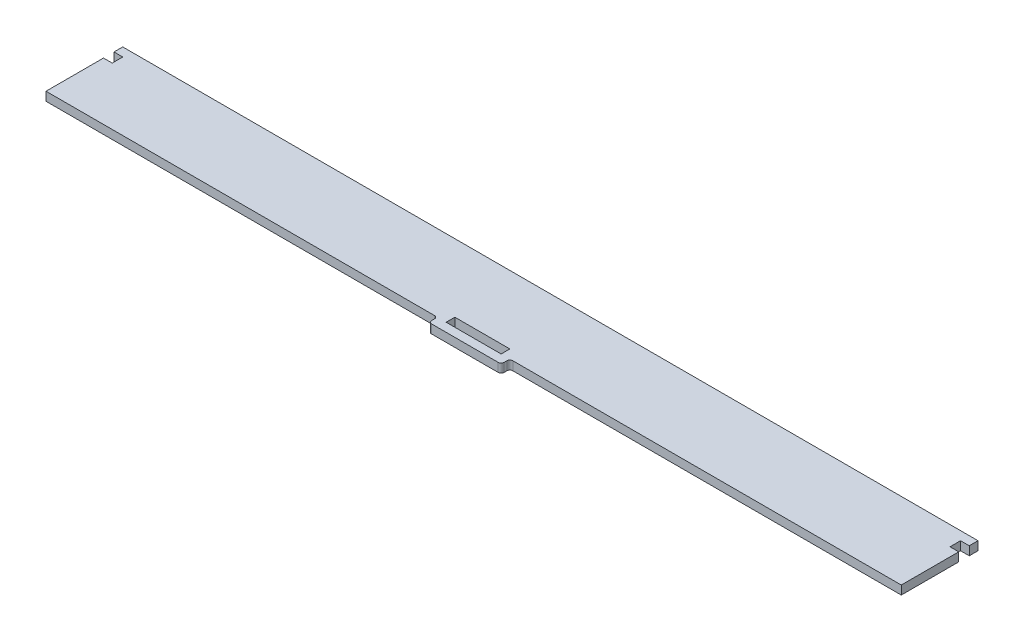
from build123d import *

# Parameters (mm, degrees)
SKETCH1_W           = 20
SKETCH1_H           = 3.175
BOSS_EXTRUDE1_DEPTH = 3.175


with BuildPart() as part:
    # Sketch1 → Boss-Extrude1 (new body)
    with BuildSketch(Plane(origin=(0, 0, 0), x_dir=(1, 0, 0), z_dir=(0, 1, 0))):
        with BuildLine():
            Line((-14.233333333, -1.5875), (-155.575, -1.5875))
            Line((-155.575, -1.5875), (-155.575, 19.322371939))
            Line((-155.575, 19.322371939), (-152.4, 19.322371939))
            Line((-152.4, 19.322371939), (-152.4, 23.15493597))
            Line((-152.4, 23.15493597), (-155.575, 23.15493597))
            Line((-155.575, 23.15493597), (-155.575, 26.32993597))
            Line((-155.575, 26.32993597), (-152.4, 26.32993597))
            Line((-152.4, 26.32993597), (152.4, 26.32993597))
            Line((152.4, 26.32993597), (155.575, 26.32993597))
            Line((155.575, 26.32993597), (155.575, 23.15493597))
            Line((155.575, 23.15493597), (152.4, 23.15493597))
            Line((152.4, 23.15493597), (152.4, 19.322371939))
            Line((152.4, 19.322371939), (155.575, 19.322371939))
            Line((155.575, 19.322371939), (155.575, -1.5875))
            Line((155.575, -1.5875), (14.233333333, -1.5875))
            ThreePointArc((14.233333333, -1.5875), (13.484978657, -1.897478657), (13.175, -2.645833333))
            Line((13.175, -2.645833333), (13.175, -3.704166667))
            ThreePointArc((13.175, -3.704166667), (12.865021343, -4.452521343), (12.116666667, -4.7625))
            Line((12.116666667, -4.7625), (-12.116666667, -4.7625))
            ThreePointArc((-12.116666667, -4.7625), (-12.865021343, -4.452521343), (-13.175, -3.704166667))
            Line((-13.175, -3.704166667), (-13.175, -2.645833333))
            ThreePointArc((-13.175, -2.645833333), (-13.484978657, -1.897478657), (-14.233333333, -1.5875))
        make_face()
        Rectangle(SKETCH1_W, SKETCH1_H, mode=Mode.SUBTRACT)
    extrude(amount=BOSS_EXTRUDE1_DEPTH)


solid = part.part
